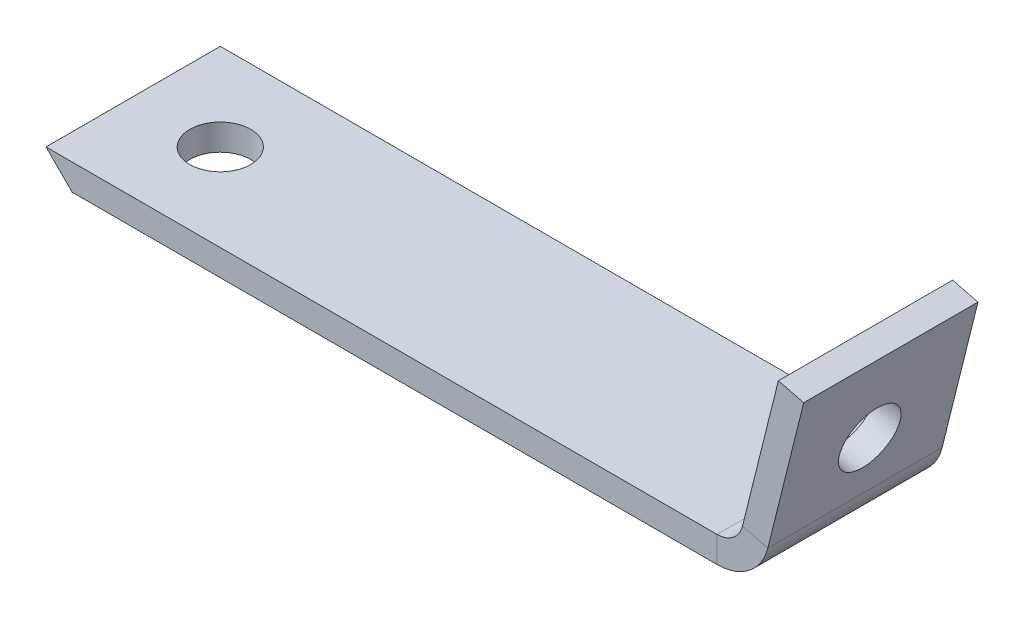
ISO-10303-21;
HEADER;
FILE_DESCRIPTION(('STEP AP214'),'2;1');
FILE_NAME('part.step','',(''),(''),'','','');
FILE_SCHEMA(('AUTOMOTIVE_DESIGN { 1 0 10303 214 1 1 1 1 }'));
ENDSEC;
DATA;
#1=APPLICATION_CONTEXT('core data for automotive mechanical design processes');
#2=APPLICATION_PROTOCOL_DEFINITION('international standard','automotive_design',2000,#1);
#3=PRODUCT_CONTEXT('',#1,'mechanical');
#4=PRODUCT('Part','Part','',(#3));
#5=PRODUCT_RELATED_PRODUCT_CATEGORY('part','',(#4));
#6=PRODUCT_DEFINITION_FORMATION('','',#4);
#7=PRODUCT_DEFINITION_CONTEXT('part definition',#1,'design');
#8=PRODUCT_DEFINITION('design','',#6,#7);
#9=PRODUCT_DEFINITION_SHAPE('','',#8);
#10=(LENGTH_UNIT() NAMED_UNIT(*) SI_UNIT(.MILLI.,.METRE.));
#11=(NAMED_UNIT(*) PLANE_ANGLE_UNIT() SI_UNIT($,.RADIAN.));
#12=(NAMED_UNIT(*) SI_UNIT($,.STERADIAN.) SOLID_ANGLE_UNIT());
#13=UNCERTAINTY_MEASURE_WITH_UNIT(LENGTH_MEASURE(1.E-05),#10,'distance_accuracy_value','');
#14=(GEOMETRIC_REPRESENTATION_CONTEXT(3) GLOBAL_UNCERTAINTY_ASSIGNED_CONTEXT((#13)) GLOBAL_UNIT_ASSIGNED_CONTEXT((#10,
#11,#12)) REPRESENTATION_CONTEXT('',''));
#15=CARTESIAN_POINT('',(0.,0.,0.));
#16=DIRECTION('',(0.,0.,1.));
#17=DIRECTION('',(1.,0.,0.));
#18=AXIS2_PLACEMENT_3D('',#15,#16,#17);
#19=CARTESIAN_POINT('',(31.380745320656,-37.9855248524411,-10.));
#20=DIRECTION('',(0.970295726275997,-0.241921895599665,0.));
#21=DIRECTION('',(0.,0.,-1.));
#22=AXIS2_PLACEMENT_3D('',#19,#20,#21);
#23=PLANE('',#22);
#24=CARTESIAN_POINT('',(42.2672306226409,5.67778282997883,-5.));
#25=DIRECTION('',(-0.970295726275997,0.241921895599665,0.));
#26=DIRECTION('',(0.,0.,1.));
#27=AXIS2_PLACEMENT_3D('',#24,#25,#26);
#28=CIRCLE('',#27,1.75);
#29=CARTESIAN_POINT('',(42.2672306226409,5.67778282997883,-3.25));
#30=VERTEX_POINT('',#29);
#31=EDGE_CURVE('E116',#30,#30,#28,.T.);
#32=ORIENTED_EDGE('',*,*,#31,.T.);
#33=EDGE_LOOP('',(#32));
#34=FACE_BOUND('',#33,.T.);
#35=DIRECTION('',(0.241921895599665,0.970295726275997,0.));
#36=VECTOR('',#35,1.);
#37=CARTESIAN_POINT('',(31.380745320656,-37.9855248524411,0.));
#38=LINE('',#37,#36);
#39=CARTESIAN_POINT('',(41.4186306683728,2.27423431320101,0.));
#40=VERTEX_POINT('',#39);
#41=CARTESIAN_POINT('',(43.4768401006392,10.5292614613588,0.));
#42=VERTEX_POINT('',#41);
#43=EDGE_CURVE('E147',#40,#42,#38,.T.);
#44=ORIENTED_EDGE('',*,*,#43,.F.);
#45=DIRECTION('',(0.,0.,-1.));
#46=VECTOR('',#45,1.);
#47=CARTESIAN_POINT('',(41.4186306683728,2.27423431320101,-10.));
#48=LINE('',#47,#46);
#49=CARTESIAN_POINT('',(41.4186306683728,2.27423431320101,-10.));
#50=VERTEX_POINT('',#49);
#51=EDGE_CURVE('E125',#40,#50,#48,.T.);
#52=ORIENTED_EDGE('',*,*,#51,.T.);
#53=DIRECTION('',(-0.241921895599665,-0.970295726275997,0.));
#54=VECTOR('',#53,1.);
#55=CARTESIAN_POINT('',(31.380745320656,-37.9855248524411,-10.));
#56=LINE('',#55,#54);
#57=CARTESIAN_POINT('',(43.4768401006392,10.5292614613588,-10.));
#58=VERTEX_POINT('',#57);
#59=EDGE_CURVE('E150',#58,#50,#56,.T.);
#60=ORIENTED_EDGE('',*,*,#59,.F.);
#61=DIRECTION('',(0.,0.,-1.));
#62=VECTOR('',#61,1.);
#63=CARTESIAN_POINT('',(43.4768401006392,10.5292614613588,0.));
#64=LINE('',#63,#62);
#65=EDGE_CURVE('E148',#42,#58,#64,.T.);
#66=ORIENTED_EDGE('',*,*,#65,.F.);
#67=EDGE_LOOP('',(#44,#52,#60,#66));
#68=FACE_BOUND('',#67,.T.);
#69=ADVANCED_FACE('F38',(#34,#68),#23,.T.);
#70=CARTESIAN_POINT('',(29.925301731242,-37.6226420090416,-10.));
#71=DIRECTION('',(0.970295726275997,-0.241921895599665,0.));
#72=DIRECTION('',(0.,0.,-1.));
#73=AXIS2_PLACEMENT_3D('',#70,#71,#72);
#74=PLANE('',#73);
#75=DIRECTION('',(0.,0.,-1.));
#76=VECTOR('',#75,1.);
#77=CARTESIAN_POINT('',(39.9631870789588,2.6371171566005,-10.));
#78=LINE('',#77,#76);
#79=CARTESIAN_POINT('',(39.9631870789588,2.6371171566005,0.));
#80=VERTEX_POINT('',#79);
#81=CARTESIAN_POINT('',(39.9631871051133,2.63711715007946,-10.));
#82=VERTEX_POINT('',#81);
#83=EDGE_CURVE('E161',#80,#82,#78,.T.);
#84=ORIENTED_EDGE('',*,*,#83,.F.);
#85=DIRECTION('',(0.241921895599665,0.970295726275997,0.));
#86=VECTOR('',#85,1.);
#87=CARTESIAN_POINT('',(29.925301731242,-37.6226420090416,0.));
#88=LINE('',#87,#86);
#89=CARTESIAN_POINT('',(42.0213965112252,10.8921443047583,0.));
#90=VERTEX_POINT('',#89);
#91=EDGE_CURVE('E154',#80,#90,#88,.T.);
#92=ORIENTED_EDGE('',*,*,#91,.T.);
#93=DIRECTION('',(0.,0.,-1.));
#94=VECTOR('',#93,1.);
#95=CARTESIAN_POINT('',(42.0213965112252,10.8921443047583,0.));
#96=LINE('',#95,#94);
#97=CARTESIAN_POINT('',(42.0213965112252,10.8921443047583,-10.));
#98=VERTEX_POINT('',#97);
#99=EDGE_CURVE('E151',#90,#98,#96,.T.);
#100=ORIENTED_EDGE('',*,*,#99,.T.);
#101=DIRECTION('',(-0.241921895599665,-0.970295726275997,0.));
#102=VECTOR('',#101,1.);
#103=CARTESIAN_POINT('',(29.925301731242,-37.6226420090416,-10.));
#104=LINE('',#103,#102);
#105=EDGE_CURVE('E153',#98,#82,#104,.T.);
#106=ORIENTED_EDGE('',*,*,#105,.T.);
#107=EDGE_LOOP('',(#84,#92,#100,#106));
#108=FACE_BOUND('',#107,.T.);
#109=CARTESIAN_POINT('',(40.8117870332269,6.04066567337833,-5.));
#110=DIRECTION('',(-0.970295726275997,0.241921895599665,0.));
#111=DIRECTION('',(0.,0.,1.));
#112=AXIS2_PLACEMENT_3D('',#109,#110,#111);
#113=CIRCLE('',#112,1.75);
#114=CARTESIAN_POINT('',(40.8117870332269,6.04066567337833,-3.25));
#115=VERTEX_POINT('',#114);
#116=EDGE_CURVE('E144',#115,#115,#113,.T.);
#117=ORIENTED_EDGE('',*,*,#116,.F.);
#118=EDGE_LOOP('',(#117));
#119=FACE_BOUND('',#118,.T.);
#120=ADVANCED_FACE('F178',(#108,#119),#74,.F.);
#121=CARTESIAN_POINT('',(29.925301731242,-37.6226420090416,0.));
#122=DIRECTION('',(0.,0.,-1.));
#123=DIRECTION('',(-0.241921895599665,-0.970295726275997,0.));
#124=AXIS2_PLACEMENT_3D('',#121,#122,#123);
#125=PLANE('',#124);
#126=DIRECTION('',(-0.970295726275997,0.241921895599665,0.));
#127=VECTOR('',#126,1.);
#128=CARTESIAN_POINT('',(39.9631870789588,2.6371171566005,0.));
#129=LINE('',#128,#127);
#130=EDGE_CURVE('E168',#40,#80,#129,.T.);
#131=ORIENTED_EDGE('',*,*,#130,.F.);
#132=ORIENTED_EDGE('',*,*,#43,.T.);
#133=DIRECTION('',(0.970295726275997,-0.241921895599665,0.));
#134=VECTOR('',#133,1.);
#135=CARTESIAN_POINT('',(42.0213965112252,10.8921443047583,0.));
#136=LINE('',#135,#134);
#137=EDGE_CURVE('E158',#90,#42,#136,.T.);
#138=ORIENTED_EDGE('',*,*,#137,.F.);
#139=ORIENTED_EDGE('',*,*,#91,.F.);
#140=EDGE_LOOP('',(#131,#132,#138,#139));
#141=FACE_BOUND('',#140,.T.);
#142=ADVANCED_FACE('F40',(#141),#125,.F.);
#143=CARTESIAN_POINT('',(42.0213965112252,10.8921443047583,0.));
#144=DIRECTION('',(-0.241921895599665,-0.970295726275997,0.));
#145=DIRECTION('',(0.,0.,1.));
#146=AXIS2_PLACEMENT_3D('',#143,#144,#145);
#147=PLANE('',#146);
#148=ORIENTED_EDGE('',*,*,#65,.T.);
#149=DIRECTION('',(0.970295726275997,-0.241921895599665,0.));
#150=VECTOR('',#149,1.);
#151=CARTESIAN_POINT('',(42.0213965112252,10.8921443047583,-10.));
#152=LINE('',#151,#150);
#153=EDGE_CURVE('E155',#98,#58,#152,.T.);
#154=ORIENTED_EDGE('',*,*,#153,.F.);
#155=ORIENTED_EDGE('',*,*,#99,.F.);
#156=ORIENTED_EDGE('',*,*,#137,.T.);
#157=EDGE_LOOP('',(#148,#154,#155,#156));
#158=FACE_BOUND('',#157,.T.);
#159=ADVANCED_FACE('F186',(#158),#147,.F.);
#160=CARTESIAN_POINT('',(29.925301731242,-37.6226420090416,-10.));
#161=DIRECTION('',(0.,0.,1.));
#162=DIRECTION('',(0.241921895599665,0.970295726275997,0.));
#163=AXIS2_PLACEMENT_3D('',#160,#161,#162);
#164=PLANE('',#163);
#165=DIRECTION('',(0.970295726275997,-0.241921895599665,0.));
#166=VECTOR('',#165,1.);
#167=CARTESIAN_POINT('',(39.9631870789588,2.6371171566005,-10.));
#168=LINE('',#167,#166);
#169=EDGE_CURVE('E164',#82,#50,#168,.T.);
#170=ORIENTED_EDGE('',*,*,#169,.F.);
#171=ORIENTED_EDGE('',*,*,#105,.F.);
#172=ORIENTED_EDGE('',*,*,#153,.T.);
#173=ORIENTED_EDGE('',*,*,#59,.T.);
#174=EDGE_LOOP('',(#170,#171,#172,#173));
#175=FACE_BOUND('',#174,.T.);
#176=ADVANCED_FACE('F190',(#175),#164,.F.);
#177=CARTESIAN_POINT('',(40.8117870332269,6.04066567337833,-5.));
#178=DIRECTION('',(0.970295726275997,-0.241921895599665,0.));
#179=DIRECTION('',(0.,0.,-1.));
#180=AXIS2_PLACEMENT_3D('',#177,#178,#179);
#181=CYLINDRICAL_SURFACE('',#180,1.75);
#182=ORIENTED_EDGE('',*,*,#116,.T.);
#183=EDGE_LOOP('',(#182));
#184=FACE_BOUND('',#183,.T.);
#185=ORIENTED_EDGE('',*,*,#31,.F.);
#186=EDGE_LOOP('',(#185));
#187=FACE_BOUND('',#186,.T.);
#188=ADVANCED_FACE('F238',(#184,#187),#181,.F.);
#189=CARTESIAN_POINT('',(5.,1.5,-5.));
#190=DIRECTION('',(0.,-1.,0.));
#191=DIRECTION('',(0.,0.,-1.));
#192=AXIS2_PLACEMENT_3D('',#189,#190,#191);
#193=CYLINDRICAL_SURFACE('',#192,1.75);
#194=CARTESIAN_POINT('',(5.,1.5,-5.));
#195=DIRECTION('',(0.,1.,0.));
#196=DIRECTION('',(0.,0.,1.));
#197=AXIS2_PLACEMENT_3D('',#194,#195,#196);
#198=CIRCLE('',#197,1.75);
#199=CARTESIAN_POINT('',(5.,1.5,-3.25));
#200=VERTEX_POINT('',#199);
#201=EDGE_CURVE('E132',#200,#200,#198,.T.);
#202=ORIENTED_EDGE('',*,*,#201,.T.);
#203=EDGE_LOOP('',(#202));
#204=FACE_BOUND('',#203,.T.);
#205=CARTESIAN_POINT('',(5.,0.,-5.));
#206=DIRECTION('',(0.,1.,0.));
#207=DIRECTION('',(0.,0.,1.));
#208=AXIS2_PLACEMENT_3D('',#205,#206,#207);
#209=CIRCLE('',#208,1.75);
#210=CARTESIAN_POINT('',(5.,0.,-3.25));
#211=VERTEX_POINT('',#210);
#212=EDGE_CURVE('E105',#211,#211,#209,.T.);
#213=ORIENTED_EDGE('',*,*,#212,.F.);
#214=EDGE_LOOP('',(#213));
#215=FACE_BOUND('',#214,.T.);
#216=ADVANCED_FACE('F226',(#204,#215),#193,.F.);
#217=CARTESIAN_POINT('',(0.,1.5,-10.));
#218=DIRECTION('',(0.,-1.,0.));
#219=DIRECTION('',(0.,0.,-1.));
#220=AXIS2_PLACEMENT_3D('',#217,#218,#219);
#221=PLANE('',#220);
#222=ORIENTED_EDGE('',*,*,#201,.F.);
#223=EDGE_LOOP('',(#222));
#224=FACE_BOUND('',#223,.T.);
#225=DIRECTION('',(1.,0.,0.));
#226=VECTOR('',#225,1.);
#227=CARTESIAN_POINT('',(0.,1.5,0.));
#228=LINE('',#227,#226);
#229=CARTESIAN_POINT('',(0.,1.5,0.));
#230=VERTEX_POINT('',#229);
#231=CARTESIAN_POINT('',(38.5077434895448,1.4999999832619,0.));
#232=VERTEX_POINT('',#231);
#233=EDGE_CURVE('E136',#230,#232,#228,.T.);
#234=ORIENTED_EDGE('',*,*,#233,.T.);
#235=DIRECTION('',(0.,0.,-1.));
#236=VECTOR('',#235,1.);
#237=CARTESIAN_POINT('',(38.5077434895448,1.5,-10.));
#238=LINE('',#237,#236);
#239=CARTESIAN_POINT('',(38.5077434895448,1.4999999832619,-10.));
#240=VERTEX_POINT('',#239);
#241=EDGE_CURVE('E210',#232,#240,#238,.T.);
#242=ORIENTED_EDGE('',*,*,#241,.T.);
#243=DIRECTION('',(-1.,0.,0.));
#244=VECTOR('',#243,1.);
#245=CARTESIAN_POINT('',(0.,1.5,-10.));
#246=LINE('',#245,#244);
#247=CARTESIAN_POINT('',(0.,1.5,-10.));
#248=VERTEX_POINT('',#247);
#249=EDGE_CURVE('E204',#240,#248,#246,.T.);
#250=ORIENTED_EDGE('',*,*,#249,.T.);
#251=DIRECTION('',(0.,0.,1.));
#252=VECTOR('',#251,1.);
#253=CARTESIAN_POINT('',(0.,1.5,0.));
#254=LINE('',#253,#252);
#255=EDGE_CURVE('E200',#248,#230,#254,.T.);
#256=ORIENTED_EDGE('',*,*,#255,.T.);
#257=EDGE_LOOP('',(#234,#242,#250,#256));
#258=FACE_BOUND('',#257,.T.);
#259=ADVANCED_FACE('F213',(#224,#258),#221,.F.);
#260=CARTESIAN_POINT('',(0.,1.5,-10.));
#261=DIRECTION('',(0.,0.,1.));
#262=DIRECTION('',(1.,0.,0.));
#263=AXIS2_PLACEMENT_3D('',#260,#261,#262);
#264=PLANE('',#263);
#265=DIRECTION('',(-1.,0.,0.));
#266=VECTOR('',#265,1.);
#267=CARTESIAN_POINT('',(0.,0.,-10.));
#268=LINE('',#267,#266);
#269=CARTESIAN_POINT('',(38.5077434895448,0.,-10.));
#270=VERTEX_POINT('',#269);
#271=CARTESIAN_POINT('',(1.50000000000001,0.,-10.));
#272=VERTEX_POINT('',#271);
#273=EDGE_CURVE('E130',#270,#272,#268,.T.);
#274=ORIENTED_EDGE('',*,*,#273,.T.);
#275=DIRECTION('',(-0.707106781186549,0.707106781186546,0.));
#276=VECTOR('',#275,1.);
#277=CARTESIAN_POINT('',(0.,1.5,-10.));
#278=LINE('',#277,#276);
#279=EDGE_CURVE('E12',#272,#248,#278,.T.);
#280=ORIENTED_EDGE('',*,*,#279,.T.);
#281=ORIENTED_EDGE('',*,*,#249,.F.);
#282=DIRECTION('',(0.,-1.,0.));
#283=VECTOR('',#282,1.);
#284=CARTESIAN_POINT('',(38.5077434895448,1.5,-10.));
#285=LINE('',#284,#283);
#286=EDGE_CURVE('E197',#240,#270,#285,.T.);
#287=ORIENTED_EDGE('',*,*,#286,.T.);
#288=EDGE_LOOP('',(#274,#280,#281,#287));
#289=FACE_BOUND('',#288,.T.);
#290=ADVANCED_FACE('F218',(#289),#264,.F.);
#291=CARTESIAN_POINT('',(0.,0.,-10.));
#292=DIRECTION('',(0.,-1.,0.));
#293=DIRECTION('',(0.,0.,-1.));
#294=AXIS2_PLACEMENT_3D('',#291,#292,#293);
#295=PLANE('',#294);
#296=DIRECTION('',(1.,0.,0.));
#297=VECTOR('',#296,1.);
#298=CARTESIAN_POINT('',(0.,0.,0.));
#299=LINE('',#298,#297);
#300=CARTESIAN_POINT('',(1.50000000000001,0.,0.));
#301=VERTEX_POINT('',#300);
#302=CARTESIAN_POINT('',(38.5077434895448,-2.69551525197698E-08,0.));
#303=VERTEX_POINT('',#302);
#304=EDGE_CURVE('E100',#301,#303,#299,.T.);
#305=ORIENTED_EDGE('',*,*,#304,.F.);
#306=DIRECTION('',(0.,0.,-1.));
#307=VECTOR('',#306,1.);
#308=CARTESIAN_POINT('',(1.50000000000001,0.,-10.));
#309=LINE('',#308,#307);
#310=EDGE_CURVE('E46',#301,#272,#309,.T.);
#311=ORIENTED_EDGE('',*,*,#310,.T.);
#312=ORIENTED_EDGE('',*,*,#273,.F.);
#313=DIRECTION('',(0.,0.,-1.));
#314=VECTOR('',#313,1.);
#315=CARTESIAN_POINT('',(38.5077434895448,0.,-10.));
#316=LINE('',#315,#314);
#317=EDGE_CURVE('E122',#303,#270,#316,.T.);
#318=ORIENTED_EDGE('',*,*,#317,.F.);
#319=EDGE_LOOP('',(#305,#311,#312,#318));
#320=FACE_BOUND('',#319,.T.);
#321=ORIENTED_EDGE('',*,*,#212,.T.);
#322=EDGE_LOOP('',(#321));
#323=FACE_BOUND('',#322,.T.);
#324=ADVANCED_FACE('F128',(#320,#323),#295,.T.);
#325=CARTESIAN_POINT('',(0.,1.5,0.));
#326=DIRECTION('',(0.,0.,-1.));
#327=DIRECTION('',(-1.,0.,0.));
#328=AXIS2_PLACEMENT_3D('',#325,#326,#327);
#329=PLANE('',#328);
#330=ORIENTED_EDGE('',*,*,#233,.F.);
#331=DIRECTION('',(0.707106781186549,-0.707106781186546,0.));
#332=VECTOR('',#331,1.);
#333=CARTESIAN_POINT('',(0.,1.5,0.));
#334=LINE('',#333,#332);
#335=EDGE_CURVE('E60',#230,#301,#334,.T.);
#336=ORIENTED_EDGE('',*,*,#335,.T.);
#337=ORIENTED_EDGE('',*,*,#304,.T.);
#338=DIRECTION('',(0.,1.,0.));
#339=VECTOR('',#338,1.);
#340=CARTESIAN_POINT('',(38.5077434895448,1.5,0.));
#341=LINE('',#340,#339);
#342=EDGE_CURVE('E103',#303,#232,#341,.T.);
#343=ORIENTED_EDGE('',*,*,#342,.T.);
#344=EDGE_LOOP('',(#330,#336,#337,#343));
#345=FACE_BOUND('',#344,.T.);
#346=ADVANCED_FACE('F102',(#345),#329,.F.);
#347=CARTESIAN_POINT('',(38.5077434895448,3.00000002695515,0.));
#348=DIRECTION('',(0.,0.,-1.));
#349=DIRECTION('',(-1.,0.,0.));
#350=AXIS2_PLACEMENT_3D('',#347,#348,#349);
#351=PLANE('',#350);
#352=ORIENTED_EDGE('',*,*,#342,.F.);
#353=CARTESIAN_POINT('',(38.5077434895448,3.,0.));
#354=DIRECTION('',(0.,0.,-1.));
#355=DIRECTION('',(-1.,0.,0.));
#356=AXIS2_PLACEMENT_3D('',#353,#354,#355);
#357=CIRCLE('',#356,3.00000002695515);
#358=EDGE_CURVE('E112',#303,#40,#357,.F.);
#359=ORIENTED_EDGE('',*,*,#358,.T.);
#360=ORIENTED_EDGE('',*,*,#130,.T.);
#361=CARTESIAN_POINT('',(38.5077434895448,3.00000002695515,0.));
#362=DIRECTION('',(0.,0.,1.));
#363=DIRECTION('',(1.,0.,0.));
#364=AXIS2_PLACEMENT_3D('',#361,#362,#363);
#365=CIRCLE('',#364,1.50000004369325);
#366=EDGE_CURVE('E114',#232,#80,#365,.T.);
#367=ORIENTED_EDGE('',*,*,#366,.F.);
#368=EDGE_LOOP('',(#352,#359,#360,#367));
#369=FACE_BOUND('',#368,.T.);
#370=ADVANCED_FACE('F110',(#369),#351,.F.);
#371=CARTESIAN_POINT('',(38.5077434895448,3.00000002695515,-10.));
#372=DIRECTION('',(0.,0.,1.));
#373=DIRECTION('',(1.,0.,0.));
#374=AXIS2_PLACEMENT_3D('',#371,#372,#373);
#375=PLANE('',#374);
#376=ORIENTED_EDGE('',*,*,#169,.T.);
#377=CARTESIAN_POINT('',(38.5077434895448,3.,-10.));
#378=DIRECTION('',(0.,0.,-1.));
#379=DIRECTION('',(-1.,0.,0.));
#380=AXIS2_PLACEMENT_3D('',#377,#378,#379);
#381=CIRCLE('',#380,3.00000002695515);
#382=EDGE_CURVE('E126',#50,#270,#381,.T.);
#383=ORIENTED_EDGE('',*,*,#382,.T.);
#384=ORIENTED_EDGE('',*,*,#286,.F.);
#385=CARTESIAN_POINT('',(38.5077434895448,3.00000002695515,-10.));
#386=DIRECTION('',(0.,0.,-1.));
#387=DIRECTION('',(-1.,0.,0.));
#388=AXIS2_PLACEMENT_3D('',#385,#386,#387);
#389=CIRCLE('',#388,1.50000004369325);
#390=EDGE_CURVE('E133',#82,#240,#389,.T.);
#391=ORIENTED_EDGE('',*,*,#390,.F.);
#392=EDGE_LOOP('',(#376,#383,#384,#391));
#393=FACE_BOUND('',#392,.T.);
#394=ADVANCED_FACE('F196',(#393),#375,.F.);
#395=CARTESIAN_POINT('',(38.5077434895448,3.,5.54311708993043));
#396=DIRECTION('',(0.,0.,-1.));
#397=DIRECTION('',(-1.,0.,0.));
#398=AXIS2_PLACEMENT_3D('',#395,#396,#397);
#399=CYLINDRICAL_SURFACE('',#398,1.50000002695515);
#400=ORIENTED_EDGE('',*,*,#390,.T.);
#401=ORIENTED_EDGE('',*,*,#241,.F.);
#402=ORIENTED_EDGE('',*,*,#366,.T.);
#403=ORIENTED_EDGE('',*,*,#83,.T.);
#404=EDGE_LOOP('',(#400,#401,#402,#403));
#405=FACE_BOUND('',#404,.T.);
#406=ADVANCED_FACE('F193',(#405),#399,.F.);
#407=CARTESIAN_POINT('',(38.5077434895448,3.,5.54311708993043));
#408=DIRECTION('',(0.,0.,-1.));
#409=DIRECTION('',(-1.,0.,0.));
#410=AXIS2_PLACEMENT_3D('',#407,#408,#409);
#411=CYLINDRICAL_SURFACE('',#410,3.00000002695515);
#412=ORIENTED_EDGE('',*,*,#382,.F.);
#413=ORIENTED_EDGE('',*,*,#51,.F.);
#414=ORIENTED_EDGE('',*,*,#358,.F.);
#415=ORIENTED_EDGE('',*,*,#317,.T.);
#416=EDGE_LOOP('',(#412,#413,#414,#415));
#417=FACE_BOUND('',#416,.T.);
#418=ADVANCED_FACE('F121',(#417),#411,.T.);
#419=CARTESIAN_POINT('',(0.,1.5,0.));
#420=DIRECTION('',(-0.707106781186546,-0.707106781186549,0.));
#421=DIRECTION('',(0.707106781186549,-0.707106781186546,0.));
#422=AXIS2_PLACEMENT_3D('',#419,#420,#421);
#423=PLANE('',#422);
#424=ORIENTED_EDGE('',*,*,#279,.F.);
#425=ORIENTED_EDGE('',*,*,#310,.F.);
#426=ORIENTED_EDGE('',*,*,#335,.F.);
#427=ORIENTED_EDGE('',*,*,#255,.F.);
#428=EDGE_LOOP('',(#424,#425,#426,#427));
#429=FACE_BOUND('',#428,.T.);
#430=ADVANCED_FACE('F217',(#429),#423,.T.);
#431=CLOSED_SHELL('',(#69,#120,#142,#159,#176,#188,#216,#259,#290,#324,#346,#370,#394,#406,#418,#430));
#432=MANIFOLD_SOLID_BREP('B2',#431);
#433=ADVANCED_BREP_SHAPE_REPRESENTATION('',(#18,#432),#14);
#434=SHAPE_DEFINITION_REPRESENTATION(#9,#433);
ENDSEC;
END-ISO-10303-21;
